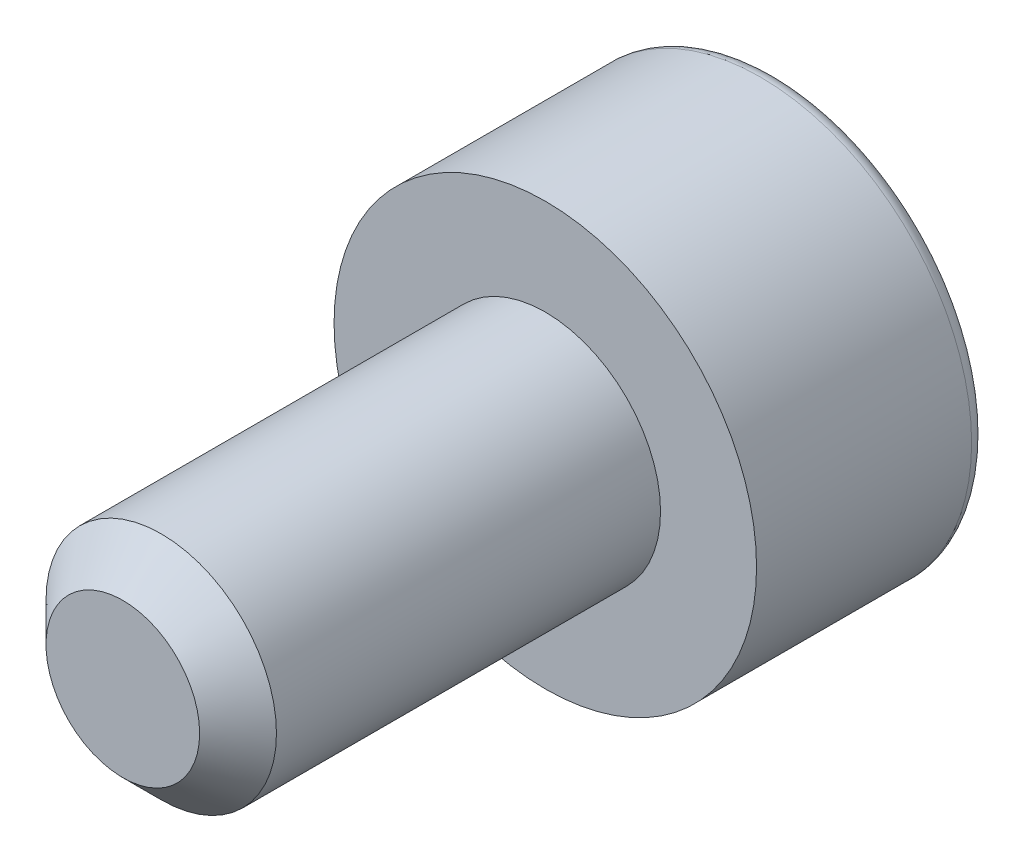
ISO-10303-21;
HEADER;
FILE_DESCRIPTION(('STEP AP214'),'2;1');
FILE_NAME('part.step','',(''),(''),'','','');
FILE_SCHEMA(('AUTOMOTIVE_DESIGN { 1 0 10303 214 1 1 1 1 }'));
ENDSEC;
DATA;
#1=APPLICATION_CONTEXT('core data for automotive mechanical design processes');
#2=APPLICATION_PROTOCOL_DEFINITION('international standard','automotive_design',2000,#1);
#3=PRODUCT_CONTEXT('',#1,'mechanical');
#4=PRODUCT('Part','Part','',(#3));
#5=PRODUCT_RELATED_PRODUCT_CATEGORY('part','',(#4));
#6=PRODUCT_DEFINITION_FORMATION('','',#4);
#7=PRODUCT_DEFINITION_CONTEXT('part definition',#1,'design');
#8=PRODUCT_DEFINITION('design','',#6,#7);
#9=PRODUCT_DEFINITION_SHAPE('','',#8);
#10=(LENGTH_UNIT() NAMED_UNIT(*) SI_UNIT(.MILLI.,.METRE.));
#11=(NAMED_UNIT(*) PLANE_ANGLE_UNIT() SI_UNIT($,.RADIAN.));
#12=(NAMED_UNIT(*) SI_UNIT($,.STERADIAN.) SOLID_ANGLE_UNIT());
#13=UNCERTAINTY_MEASURE_WITH_UNIT(LENGTH_MEASURE(1.E-05),#10,'distance_accuracy_value','');
#14=(GEOMETRIC_REPRESENTATION_CONTEXT(3) GLOBAL_UNCERTAINTY_ASSIGNED_CONTEXT((#13)) GLOBAL_UNIT_ASSIGNED_CONTEXT((#10,
#11,#12)) REPRESENTATION_CONTEXT('',''));
#15=CARTESIAN_POINT('',(0.,0.,0.));
#16=DIRECTION('',(0.,0.,1.));
#17=DIRECTION('',(1.,0.,0.));
#18=AXIS2_PLACEMENT_3D('',#15,#16,#17);
#19=CARTESIAN_POINT('',(0.,0.,3.));
#20=DIRECTION('',(0.,0.,1.));
#21=DIRECTION('',(1.,0.,0.));
#22=AXIS2_PLACEMENT_3D('',#19,#20,#21);
#23=PLANE('',#22);
#24=CARTESIAN_POINT('',(0.,0.,3.));
#25=DIRECTION('',(0.,0.,1.));
#26=DIRECTION('',(1.,0.,0.));
#27=AXIS2_PLACEMENT_3D('',#24,#25,#26);
#28=CIRCLE('',#27,2.75);
#29=CARTESIAN_POINT('',(2.75,0.,3.));
#30=VERTEX_POINT('',#29);
#31=EDGE_CURVE('E226',#30,#30,#28,.T.);
#32=ORIENTED_EDGE('',*,*,#31,.T.);
#33=EDGE_LOOP('',(#32));
#34=FACE_BOUND('',#33,.T.);
#35=CARTESIAN_POINT('',(0.,0.,3.));
#36=DIRECTION('',(0.,0.,1.));
#37=DIRECTION('',(1.,0.,0.));
#38=AXIS2_PLACEMENT_3D('',#35,#36,#37);
#39=CIRCLE('',#38,1.5);
#40=CARTESIAN_POINT('',(1.5,0.,3.));
#41=VERTEX_POINT('',#40);
#42=EDGE_CURVE('E228',#41,#41,#39,.T.);
#43=ORIENTED_EDGE('',*,*,#42,.F.);
#44=EDGE_LOOP('',(#43));
#45=FACE_BOUND('',#44,.T.);
#46=ADVANCED_FACE('F24',(#34,#45),#23,.T.);
#47=CARTESIAN_POINT('',(0.,0.,3.));
#48=DIRECTION('',(0.,0.,-1.));
#49=DIRECTION('',(-1.,0.,0.));
#50=AXIS2_PLACEMENT_3D('',#47,#48,#49);
#51=CYLINDRICAL_SURFACE('',#50,2.75);
#52=CARTESIAN_POINT('',(0.,0.,0.2));
#53=DIRECTION('',(0.,0.,1.));
#54=DIRECTION('',(1.,0.,0.));
#55=AXIS2_PLACEMENT_3D('',#52,#53,#54);
#56=CIRCLE('',#55,2.75);
#57=CARTESIAN_POINT('',(2.75,0.,0.2));
#58=VERTEX_POINT('',#57);
#59=EDGE_CURVE('E195',#58,#58,#56,.T.);
#60=ORIENTED_EDGE('',*,*,#59,.T.);
#61=EDGE_LOOP('',(#60));
#62=FACE_BOUND('',#61,.T.);
#63=ORIENTED_EDGE('',*,*,#31,.F.);
#64=EDGE_LOOP('',(#63));
#65=FACE_BOUND('',#64,.T.);
#66=ADVANCED_FACE('F26',(#62,#65),#51,.T.);
#67=CARTESIAN_POINT('',(0.,0.,0.));
#68=DIRECTION('',(0.,0.,1.));
#69=DIRECTION('',(1.,0.,0.));
#70=AXIS2_PLACEMENT_3D('',#67,#68,#69);
#71=PLANE('',#70);
#72=DIRECTION('',(0.5,0.866025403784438,0.));
#73=VECTOR('',#72,1.);
#74=CARTESIAN_POINT('',(-1.25573683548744,0.725000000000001,0.));
#75=LINE('',#74,#73);
#76=CARTESIAN_POINT('',(-0.837157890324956,1.45,0.));
#77=VERTEX_POINT('',#76);
#78=CARTESIAN_POINT('',(-1.67431578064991,0.,0.));
#79=VERTEX_POINT('',#78);
#80=EDGE_CURVE('E210',#77,#79,#75,.F.);
#81=ORIENTED_EDGE('',*,*,#80,.T.);
#82=DIRECTION('',(-0.5,0.866025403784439,0.));
#83=VECTOR('',#82,1.);
#84=CARTESIAN_POINT('',(-1.25573683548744,-0.725,0.));
#85=LINE('',#84,#83);
#86=CARTESIAN_POINT('',(-0.837157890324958,-1.45,0.));
#87=VERTEX_POINT('',#86);
#88=EDGE_CURVE('E207',#79,#87,#85,.F.);
#89=ORIENTED_EDGE('',*,*,#88,.T.);
#90=DIRECTION('',(-1.,0.,0.));
#91=VECTOR('',#90,1.);
#92=CARTESIAN_POINT('',(0.,-1.45,0.));
#93=LINE('',#92,#91);
#94=CARTESIAN_POINT('',(0.837157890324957,-1.45,0.));
#95=VERTEX_POINT('',#94);
#96=EDGE_CURVE('E218',#87,#95,#93,.F.);
#97=ORIENTED_EDGE('',*,*,#96,.T.);
#98=DIRECTION('',(-0.500000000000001,-0.866025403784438,0.));
#99=VECTOR('',#98,1.);
#100=CARTESIAN_POINT('',(1.25573683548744,-0.725000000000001,0.));
#101=LINE('',#100,#99);
#102=CARTESIAN_POINT('',(1.67431578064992,0.,0.));
#103=VERTEX_POINT('',#102);
#104=EDGE_CURVE('E216',#95,#103,#101,.F.);
#105=ORIENTED_EDGE('',*,*,#104,.T.);
#106=DIRECTION('',(0.5,-0.866025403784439,0.));
#107=VECTOR('',#106,1.);
#108=CARTESIAN_POINT('',(1.25573683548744,0.725,0.));
#109=LINE('',#108,#107);
#110=CARTESIAN_POINT('',(0.837157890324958,1.45,0.));
#111=VERTEX_POINT('',#110);
#112=EDGE_CURVE('E214',#103,#111,#109,.F.);
#113=ORIENTED_EDGE('',*,*,#112,.T.);
#114=DIRECTION('',(1.,0.,0.));
#115=VECTOR('',#114,1.);
#116=CARTESIAN_POINT('',(0.,1.45,0.));
#117=LINE('',#116,#115);
#118=EDGE_CURVE('E212',#111,#77,#117,.F.);
#119=ORIENTED_EDGE('',*,*,#118,.T.);
#120=EDGE_LOOP('',(#81,#89,#97,#105,#113,#119));
#121=FACE_BOUND('',#120,.T.);
#122=CARTESIAN_POINT('',(0.,0.,0.));
#123=DIRECTION('',(0.,0.,1.));
#124=DIRECTION('',(1.,0.,0.));
#125=AXIS2_PLACEMENT_3D('',#122,#123,#124);
#126=CIRCLE('',#125,2.55);
#127=CARTESIAN_POINT('',(2.55,0.,0.));
#128=VERTEX_POINT('',#127);
#129=EDGE_CURVE('E220',#128,#128,#126,.F.);
#130=ORIENTED_EDGE('',*,*,#129,.T.);
#131=EDGE_LOOP('',(#130));
#132=FACE_BOUND('',#131,.T.);
#133=ADVANCED_FACE('F118',(#121,#132),#71,.F.);
#134=CARTESIAN_POINT('',(0.,0.,8.5));
#135=DIRECTION('',(0.,0.,-1.));
#136=DIRECTION('',(-1.,0.,0.));
#137=AXIS2_PLACEMENT_3D('',#134,#135,#136);
#138=CYLINDRICAL_SURFACE('',#137,1.5);
#139=CARTESIAN_POINT('',(0.,0.,8.));
#140=DIRECTION('',(0.,0.,1.));
#141=DIRECTION('',(1.,0.,0.));
#142=AXIS2_PLACEMENT_3D('',#139,#140,#141);
#143=CIRCLE('',#142,1.5);
#144=CARTESIAN_POINT('',(1.5,0.,8.));
#145=VERTEX_POINT('',#144);
#146=EDGE_CURVE('E11',#145,#145,#143,.F.);
#147=ORIENTED_EDGE('',*,*,#146,.T.);
#148=EDGE_LOOP('',(#147));
#149=FACE_BOUND('',#148,.T.);
#150=ORIENTED_EDGE('',*,*,#42,.T.);
#151=EDGE_LOOP('',(#150));
#152=FACE_BOUND('',#151,.T.);
#153=ADVANCED_FACE('F125',(#149,#152),#138,.T.);
#154=CARTESIAN_POINT('',(0.,0.,8.5));
#155=DIRECTION('',(0.,0.,1.));
#156=DIRECTION('',(1.,0.,0.));
#157=AXIS2_PLACEMENT_3D('',#154,#155,#156);
#158=PLANE('',#157);
#159=CARTESIAN_POINT('',(0.,0.,8.5));
#160=DIRECTION('',(0.,0.,1.));
#161=DIRECTION('',(1.,0.,0.));
#162=AXIS2_PLACEMENT_3D('',#159,#160,#161);
#163=CIRCLE('',#162,0.999999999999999);
#164=CARTESIAN_POINT('',(0.999999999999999,0.,8.5));
#165=VERTEX_POINT('',#164);
#166=EDGE_CURVE('E32',#165,#165,#163,.T.);
#167=ORIENTED_EDGE('',*,*,#166,.T.);
#168=EDGE_LOOP('',(#167));
#169=FACE_BOUND('',#168,.T.);
#170=ADVANCED_FACE('F129',(#169),#158,.T.);
#171=CARTESIAN_POINT('',(1.44337567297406,0.,1.9));
#172=DIRECTION('',(0.866025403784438,-0.500000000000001,0.));
#173=DIRECTION('',(0.500000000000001,0.866025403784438,0.));
#174=AXIS2_PLACEMENT_3D('',#171,#172,#173);
#175=PLANE('',#174);
#176=DIRECTION('',(0.,0.,-1.));
#177=VECTOR('',#176,1.);
#178=CARTESIAN_POINT('',(1.44337567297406,0.,1.9));
#179=LINE('',#178,#177);
#180=CARTESIAN_POINT('',(1.44337567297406,0.,1.9));
#181=VERTEX_POINT('',#180);
#182=CARTESIAN_POINT('',(1.44337567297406,0.,0.200000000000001));
#183=VERTEX_POINT('',#182);
#184=EDGE_CURVE('E231',#181,#183,#179,.T.);
#185=ORIENTED_EDGE('',*,*,#184,.T.);
#186=DIRECTION('',(-0.500000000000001,-0.866025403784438,0.));
#187=VECTOR('',#186,1.);
#188=CARTESIAN_POINT('',(1.44337567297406,0.,0.2));
#189=LINE('',#188,#187);
#190=CARTESIAN_POINT('',(0.721687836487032,-1.25,0.200000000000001));
#191=VERTEX_POINT('',#190);
#192=EDGE_CURVE('E39',#183,#191,#189,.T.);
#193=ORIENTED_EDGE('',*,*,#192,.T.);
#194=DIRECTION('',(0.,0.,-1.));
#195=VECTOR('',#194,1.);
#196=CARTESIAN_POINT('',(0.721687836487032,-1.25,1.9));
#197=LINE('',#196,#195);
#198=CARTESIAN_POINT('',(0.721687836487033,-1.25,1.9));
#199=VERTEX_POINT('',#198);
#200=EDGE_CURVE('E232',#199,#191,#197,.T.);
#201=ORIENTED_EDGE('',*,*,#200,.F.);
#202=DIRECTION('',(-0.500000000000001,-0.866025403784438,0.));
#203=VECTOR('',#202,1.);
#204=CARTESIAN_POINT('',(1.44337567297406,0.,1.9));
#205=LINE('',#204,#203);
#206=EDGE_CURVE('E257',#181,#199,#205,.T.);
#207=ORIENTED_EDGE('',*,*,#206,.F.);
#208=EDGE_LOOP('',(#185,#193,#201,#207));
#209=FACE_BOUND('',#208,.T.);
#210=ADVANCED_FACE('F133',(#209),#175,.F.);
#211=CARTESIAN_POINT('',(0.721687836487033,1.25,1.9));
#212=DIRECTION('',(0.866025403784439,0.5,0.));
#213=DIRECTION('',(-0.5,0.866025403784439,0.));
#214=AXIS2_PLACEMENT_3D('',#211,#212,#213);
#215=PLANE('',#214);
#216=DIRECTION('',(0.,0.,-1.));
#217=VECTOR('',#216,1.);
#218=CARTESIAN_POINT('',(0.721687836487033,1.25,1.9));
#219=LINE('',#218,#217);
#220=CARTESIAN_POINT('',(0.721687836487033,1.25,1.9));
#221=VERTEX_POINT('',#220);
#222=CARTESIAN_POINT('',(0.721687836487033,1.25,0.200000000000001));
#223=VERTEX_POINT('',#222);
#224=EDGE_CURVE('E244',#221,#223,#219,.T.);
#225=ORIENTED_EDGE('',*,*,#224,.T.);
#226=DIRECTION('',(0.5,-0.866025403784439,0.));
#227=VECTOR('',#226,1.);
#228=CARTESIAN_POINT('',(0.721687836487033,1.25,0.2));
#229=LINE('',#228,#227);
#230=EDGE_CURVE('E47',#223,#183,#229,.T.);
#231=ORIENTED_EDGE('',*,*,#230,.T.);
#232=ORIENTED_EDGE('',*,*,#184,.F.);
#233=DIRECTION('',(0.5,-0.866025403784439,0.));
#234=VECTOR('',#233,1.);
#235=CARTESIAN_POINT('',(0.721687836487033,1.25,1.9));
#236=LINE('',#235,#234);
#237=EDGE_CURVE('E235',#221,#181,#236,.T.);
#238=ORIENTED_EDGE('',*,*,#237,.F.);
#239=EDGE_LOOP('',(#225,#231,#232,#238));
#240=FACE_BOUND('',#239,.T.);
#241=ADVANCED_FACE('F137',(#240),#215,.F.);
#242=CARTESIAN_POINT('',(-0.721687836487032,1.25,1.9));
#243=DIRECTION('',(0.,1.,0.));
#244=DIRECTION('',(-1.,0.,0.));
#245=AXIS2_PLACEMENT_3D('',#242,#243,#244);
#246=PLANE('',#245);
#247=DIRECTION('',(0.,0.,-1.));
#248=VECTOR('',#247,1.);
#249=CARTESIAN_POINT('',(-0.721687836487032,1.25,1.9));
#250=LINE('',#249,#248);
#251=CARTESIAN_POINT('',(-0.721687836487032,1.25,1.9));
#252=VERTEX_POINT('',#251);
#253=CARTESIAN_POINT('',(-0.721687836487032,1.25,0.200000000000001));
#254=VERTEX_POINT('',#253);
#255=EDGE_CURVE('E241',#252,#254,#250,.T.);
#256=ORIENTED_EDGE('',*,*,#255,.T.);
#257=DIRECTION('',(1.,0.,0.));
#258=VECTOR('',#257,1.);
#259=CARTESIAN_POINT('',(-0.721687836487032,1.25,0.2));
#260=LINE('',#259,#258);
#261=EDGE_CURVE('E203',#254,#223,#260,.T.);
#262=ORIENTED_EDGE('',*,*,#261,.T.);
#263=ORIENTED_EDGE('',*,*,#224,.F.);
#264=DIRECTION('',(1.,0.,0.));
#265=VECTOR('',#264,1.);
#266=CARTESIAN_POINT('',(-0.721687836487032,1.25,1.9));
#267=LINE('',#266,#265);
#268=EDGE_CURVE('E248',#252,#221,#267,.T.);
#269=ORIENTED_EDGE('',*,*,#268,.F.);
#270=EDGE_LOOP('',(#256,#262,#263,#269));
#271=FACE_BOUND('',#270,.T.);
#272=ADVANCED_FACE('F150',(#271),#246,.F.);
#273=CARTESIAN_POINT('',(-1.44337567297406,0.,1.9));
#274=DIRECTION('',(-0.866025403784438,0.5,0.));
#275=DIRECTION('',(-0.5,-0.866025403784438,0.));
#276=AXIS2_PLACEMENT_3D('',#273,#274,#275);
#277=PLANE('',#276);
#278=DIRECTION('',(0.,0.,-1.));
#279=VECTOR('',#278,1.);
#280=CARTESIAN_POINT('',(-1.44337567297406,0.,1.9));
#281=LINE('',#280,#279);
#282=CARTESIAN_POINT('',(-1.44337567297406,0.,1.9));
#283=VERTEX_POINT('',#282);
#284=CARTESIAN_POINT('',(-1.44337567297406,0.,0.200000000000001));
#285=VERTEX_POINT('',#284);
#286=EDGE_CURVE('E238',#283,#285,#281,.T.);
#287=ORIENTED_EDGE('',*,*,#286,.T.);
#288=DIRECTION('',(0.5,0.866025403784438,0.));
#289=VECTOR('',#288,1.);
#290=CARTESIAN_POINT('',(-1.44337567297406,0.,0.2));
#291=LINE('',#290,#289);
#292=EDGE_CURVE('E205',#285,#254,#291,.T.);
#293=ORIENTED_EDGE('',*,*,#292,.T.);
#294=ORIENTED_EDGE('',*,*,#255,.F.);
#295=DIRECTION('',(0.5,0.866025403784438,0.));
#296=VECTOR('',#295,1.);
#297=CARTESIAN_POINT('',(-1.44337567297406,0.,1.9));
#298=LINE('',#297,#296);
#299=EDGE_CURVE('E251',#283,#252,#298,.T.);
#300=ORIENTED_EDGE('',*,*,#299,.F.);
#301=EDGE_LOOP('',(#287,#293,#294,#300));
#302=FACE_BOUND('',#301,.T.);
#303=ADVANCED_FACE('F146',(#302),#277,.F.);
#304=CARTESIAN_POINT('',(-0.721687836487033,-1.25,1.9));
#305=DIRECTION('',(-0.866025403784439,-0.5,0.));
#306=DIRECTION('',(0.5,-0.866025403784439,0.));
#307=AXIS2_PLACEMENT_3D('',#304,#305,#306);
#308=PLANE('',#307);
#309=DIRECTION('',(0.,0.,-1.));
#310=VECTOR('',#309,1.);
#311=CARTESIAN_POINT('',(-0.721687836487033,-1.25,1.9));
#312=LINE('',#311,#310);
#313=CARTESIAN_POINT('',(-0.721687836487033,-1.25,1.9));
#314=VERTEX_POINT('',#313);
#315=CARTESIAN_POINT('',(-0.721687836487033,-1.25,0.200000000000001));
#316=VERTEX_POINT('',#315);
#317=EDGE_CURVE('E234',#314,#316,#312,.T.);
#318=ORIENTED_EDGE('',*,*,#317,.T.);
#319=DIRECTION('',(-0.5,0.866025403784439,0.));
#320=VECTOR('',#319,1.);
#321=CARTESIAN_POINT('',(-0.721687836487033,-1.25,0.2));
#322=LINE('',#321,#320);
#323=EDGE_CURVE('E223',#316,#285,#322,.T.);
#324=ORIENTED_EDGE('',*,*,#323,.T.);
#325=ORIENTED_EDGE('',*,*,#286,.F.);
#326=DIRECTION('',(-0.5,0.866025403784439,0.));
#327=VECTOR('',#326,1.);
#328=CARTESIAN_POINT('',(-0.721687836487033,-1.25,1.9));
#329=LINE('',#328,#327);
#330=EDGE_CURVE('E253',#314,#283,#329,.T.);
#331=ORIENTED_EDGE('',*,*,#330,.F.);
#332=EDGE_LOOP('',(#318,#324,#325,#331));
#333=FACE_BOUND('',#332,.T.);
#334=ADVANCED_FACE('F142',(#333),#308,.F.);
#335=CARTESIAN_POINT('',(0.721687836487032,-1.25,1.9));
#336=DIRECTION('',(0.,-1.,0.));
#337=DIRECTION('',(1.,0.,0.));
#338=AXIS2_PLACEMENT_3D('',#335,#336,#337);
#339=PLANE('',#338);
#340=ORIENTED_EDGE('',*,*,#200,.T.);
#341=DIRECTION('',(-1.,0.,0.));
#342=VECTOR('',#341,1.);
#343=CARTESIAN_POINT('',(0.721687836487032,-1.25,0.2));
#344=LINE('',#343,#342);
#345=EDGE_CURVE('E197',#191,#316,#344,.T.);
#346=ORIENTED_EDGE('',*,*,#345,.T.);
#347=ORIENTED_EDGE('',*,*,#317,.F.);
#348=DIRECTION('',(-1.,0.,0.));
#349=VECTOR('',#348,1.);
#350=CARTESIAN_POINT('',(0.721687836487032,-1.25,1.9));
#351=LINE('',#350,#349);
#352=EDGE_CURVE('E255',#199,#314,#351,.T.);
#353=ORIENTED_EDGE('',*,*,#352,.F.);
#354=EDGE_LOOP('',(#340,#346,#347,#353));
#355=FACE_BOUND('',#354,.T.);
#356=ADVANCED_FACE('F138',(#355),#339,.F.);
#357=CARTESIAN_POINT('',(0.894892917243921,1.35,0.2));
#358=DIRECTION('',(0.5,-0.866025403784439,0.));
#359=DIRECTION('',(0.866025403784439,0.5,0.));
#360=AXIS2_PLACEMENT_3D('',#357,#358,#359);
#361=CYLINDRICAL_SURFACE('',#360,0.2);
#362=CARTESIAN_POINT('',(0.837157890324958,1.45,0.2));
#363=DIRECTION('',(0.866025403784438,-0.5,0.));
#364=DIRECTION('',(0.5,0.866025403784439,0.));
#365=AXIS2_PLACEMENT_3D('',#362,#363,#364);
#366=ELLIPSE('',#365,0.23094010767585,0.2);
#367=EDGE_CURVE('E262',#111,#223,#366,.F.);
#368=ORIENTED_EDGE('',*,*,#367,.F.);
#369=ORIENTED_EDGE('',*,*,#112,.F.);
#370=CARTESIAN_POINT('',(1.67431578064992,0.,0.2));
#371=DIRECTION('',(0.,-1.,0.));
#372=DIRECTION('',(1.,0.,0.));
#373=AXIS2_PLACEMENT_3D('',#370,#371,#372);
#374=ELLIPSE('',#373,0.23094010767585,0.2);
#375=EDGE_CURVE('E259',#183,#103,#374,.T.);
#376=ORIENTED_EDGE('',*,*,#375,.F.);
#377=ORIENTED_EDGE('',*,*,#230,.F.);
#378=EDGE_LOOP('',(#368,#369,#376,#377));
#379=FACE_BOUND('',#378,.T.);
#380=ADVANCED_FACE('F141',(#379),#361,.T.);
#381=CARTESIAN_POINT('',(1.61658075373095,-0.1,0.2));
#382=DIRECTION('',(-0.500000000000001,-0.866025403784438,0.));
#383=DIRECTION('',(0.866025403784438,-0.500000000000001,0.));
#384=AXIS2_PLACEMENT_3D('',#381,#382,#383);
#385=CYLINDRICAL_SURFACE('',#384,0.2);
#386=ORIENTED_EDGE('',*,*,#375,.T.);
#387=ORIENTED_EDGE('',*,*,#104,.F.);
#388=CARTESIAN_POINT('',(0.837157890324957,-1.45,0.2));
#389=DIRECTION('',(-0.866025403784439,-0.5,0.));
#390=DIRECTION('',(0.499999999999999,-0.866025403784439,0.));
#391=AXIS2_PLACEMENT_3D('',#388,#389,#390);
#392=ELLIPSE('',#391,0.23094010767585,0.2);
#393=EDGE_CURVE('E265',#191,#95,#392,.T.);
#394=ORIENTED_EDGE('',*,*,#393,.F.);
#395=ORIENTED_EDGE('',*,*,#192,.F.);
#396=EDGE_LOOP('',(#386,#387,#394,#395));
#397=FACE_BOUND('',#396,.T.);
#398=ADVANCED_FACE('F159',(#397),#385,.T.);
#399=CARTESIAN_POINT('',(-0.721687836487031,1.45,0.2));
#400=DIRECTION('',(1.,0.,0.));
#401=DIRECTION('',(0.,1.,0.));
#402=AXIS2_PLACEMENT_3D('',#399,#400,#401);
#403=CYLINDRICAL_SURFACE('',#402,0.2);
#404=ORIENTED_EDGE('',*,*,#367,.T.);
#405=ORIENTED_EDGE('',*,*,#261,.F.);
#406=CARTESIAN_POINT('',(-0.837157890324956,1.45,0.2));
#407=DIRECTION('',(0.866025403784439,0.5,0.));
#408=DIRECTION('',(-0.5,0.866025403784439,0.));
#409=AXIS2_PLACEMENT_3D('',#406,#407,#408);
#410=ELLIPSE('',#409,0.23094010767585,0.2);
#411=EDGE_CURVE('E268',#77,#254,#410,.F.);
#412=ORIENTED_EDGE('',*,*,#411,.F.);
#413=ORIENTED_EDGE('',*,*,#118,.F.);
#414=EDGE_LOOP('',(#404,#405,#412,#413));
#415=FACE_BOUND('',#414,.T.);
#416=ADVANCED_FACE('F163',(#415),#403,.T.);
#417=CARTESIAN_POINT('',(0.721687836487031,-1.45,0.2));
#418=DIRECTION('',(-1.,0.,0.));
#419=DIRECTION('',(0.,-1.,0.));
#420=AXIS2_PLACEMENT_3D('',#417,#418,#419);
#421=CYLINDRICAL_SURFACE('',#420,0.2);
#422=ORIENTED_EDGE('',*,*,#393,.T.);
#423=ORIENTED_EDGE('',*,*,#96,.F.);
#424=CARTESIAN_POINT('',(-0.837157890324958,-1.45,0.2));
#425=DIRECTION('',(-0.866025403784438,0.5,0.));
#426=DIRECTION('',(0.5,0.866025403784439,0.));
#427=AXIS2_PLACEMENT_3D('',#424,#425,#426);
#428=ELLIPSE('',#427,0.23094010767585,0.2);
#429=EDGE_CURVE('E271',#316,#87,#428,.T.);
#430=ORIENTED_EDGE('',*,*,#429,.F.);
#431=ORIENTED_EDGE('',*,*,#345,.F.);
#432=EDGE_LOOP('',(#422,#423,#430,#431));
#433=FACE_BOUND('',#432,.T.);
#434=ADVANCED_FACE('F167',(#433),#421,.T.);
#435=CARTESIAN_POINT('',(-1.61658075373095,0.100000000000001,0.2));
#436=DIRECTION('',(0.5,0.866025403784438,0.));
#437=DIRECTION('',(-0.866025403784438,0.5,0.));
#438=AXIS2_PLACEMENT_3D('',#435,#436,#437);
#439=CYLINDRICAL_SURFACE('',#438,0.2);
#440=ORIENTED_EDGE('',*,*,#411,.T.);
#441=ORIENTED_EDGE('',*,*,#292,.F.);
#442=CARTESIAN_POINT('',(-1.67431578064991,0.,0.2));
#443=DIRECTION('',(0.,1.,0.));
#444=DIRECTION('',(-1.,0.,0.));
#445=AXIS2_PLACEMENT_3D('',#442,#443,#444);
#446=ELLIPSE('',#445,0.23094010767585,0.2);
#447=EDGE_CURVE('E273',#79,#285,#446,.F.);
#448=ORIENTED_EDGE('',*,*,#447,.F.);
#449=ORIENTED_EDGE('',*,*,#80,.F.);
#450=EDGE_LOOP('',(#440,#441,#448,#449));
#451=FACE_BOUND('',#450,.T.);
#452=ADVANCED_FACE('F171',(#451),#439,.T.);
#453=CARTESIAN_POINT('',(-0.894892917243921,-1.35,0.2));
#454=DIRECTION('',(-0.5,0.866025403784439,0.));
#455=DIRECTION('',(-0.866025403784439,-0.5,0.));
#456=AXIS2_PLACEMENT_3D('',#453,#454,#455);
#457=CYLINDRICAL_SURFACE('',#456,0.2);
#458=ORIENTED_EDGE('',*,*,#429,.T.);
#459=ORIENTED_EDGE('',*,*,#88,.F.);
#460=ORIENTED_EDGE('',*,*,#447,.T.);
#461=ORIENTED_EDGE('',*,*,#323,.F.);
#462=EDGE_LOOP('',(#458,#459,#460,#461));
#463=FACE_BOUND('',#462,.T.);
#464=ADVANCED_FACE('F175',(#463),#457,.T.);
#465=CARTESIAN_POINT('',(0.,0.,0.2));
#466=DIRECTION('',(0.,0.,1.));
#467=DIRECTION('',(1.,0.,0.));
#468=AXIS2_PLACEMENT_3D('',#465,#466,#467);
#469=TOROIDAL_SURFACE('',#468,2.55,0.2);
#470=ORIENTED_EDGE('',*,*,#129,.F.);
#471=EDGE_LOOP('',(#470));
#472=FACE_BOUND('',#471,.T.);
#473=ORIENTED_EDGE('',*,*,#59,.F.);
#474=EDGE_LOOP('',(#473));
#475=FACE_BOUND('',#474,.T.);
#476=ADVANCED_FACE('F179',(#472,#475),#469,.T.);
#477=CARTESIAN_POINT('',(0.,0.,8.5));
#478=DIRECTION('',(0.,0.,-1.));
#479=DIRECTION('',(-1.,0.,0.));
#480=AXIS2_PLACEMENT_3D('',#477,#478,#479);
#481=CONICAL_SURFACE('',#480,0.999999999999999,0.785398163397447);
#482=ORIENTED_EDGE('',*,*,#146,.F.);
#483=EDGE_LOOP('',(#482));
#484=FACE_BOUND('',#483,.T.);
#485=ORIENTED_EDGE('',*,*,#166,.F.);
#486=EDGE_LOOP('',(#485));
#487=FACE_BOUND('',#486,.T.);
#488=ADVANCED_FACE('F182',(#484,#487),#481,.T.);
#489=CARTESIAN_POINT('',(1.44337567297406,0.,1.9));
#490=DIRECTION('',(0.,0.,1.));
#491=DIRECTION('',(1.,0.,0.));
#492=AXIS2_PLACEMENT_3D('',#489,#490,#491);
#493=PLANE('',#492);
#494=ORIENTED_EDGE('',*,*,#206,.T.);
#495=CARTESIAN_POINT('',(0.,0.,1.9));
#496=DIRECTION('',(0.,0.,-1.));
#497=DIRECTION('',(-1.,0.,0.));
#498=AXIS2_PLACEMENT_3D('',#495,#496,#497);
#499=CIRCLE('',#498,1.44337567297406);
#500=EDGE_CURVE('E285',#181,#199,#499,.T.);
#501=ORIENTED_EDGE('',*,*,#500,.F.);
#502=EDGE_LOOP('',(#494,#501));
#503=FACE_BOUND('',#502,.T.);
#504=ADVANCED_FACE('F110',(#503),#493,.T.);
#505=ORIENTED_EDGE('',*,*,#352,.T.);
#506=EDGE_CURVE('E282',#199,#314,#499,.T.);
#507=ORIENTED_EDGE('',*,*,#506,.F.);
#508=EDGE_LOOP('',(#505,#507));
#509=FACE_BOUND('',#508,.T.);
#510=ADVANCED_FACE('F189',(#509),#493,.T.);
#511=ORIENTED_EDGE('',*,*,#330,.T.);
#512=EDGE_CURVE('E277',#314,#283,#499,.T.);
#513=ORIENTED_EDGE('',*,*,#512,.F.);
#514=EDGE_LOOP('',(#511,#513));
#515=FACE_BOUND('',#514,.T.);
#516=ADVANCED_FACE('F299',(#515),#493,.T.);
#517=ORIENTED_EDGE('',*,*,#299,.T.);
#518=EDGE_CURVE('E275',#283,#252,#499,.T.);
#519=ORIENTED_EDGE('',*,*,#518,.F.);
#520=EDGE_LOOP('',(#517,#519));
#521=FACE_BOUND('',#520,.T.);
#522=ADVANCED_FACE('F307',(#521),#493,.T.);
#523=ORIENTED_EDGE('',*,*,#268,.T.);
#524=EDGE_CURVE('E276',#252,#221,#499,.T.);
#525=ORIENTED_EDGE('',*,*,#524,.F.);
#526=EDGE_LOOP('',(#523,#525));
#527=FACE_BOUND('',#526,.T.);
#528=ADVANCED_FACE('F107',(#527),#493,.T.);
#529=ORIENTED_EDGE('',*,*,#237,.T.);
#530=EDGE_CURVE('E281',#221,#181,#499,.T.);
#531=ORIENTED_EDGE('',*,*,#530,.F.);
#532=EDGE_LOOP('',(#529,#531));
#533=FACE_BOUND('',#532,.T.);
#534=ADVANCED_FACE('F101',(#533),#493,.T.);
#535=CARTESIAN_POINT('',(0.,0.,2.5));
#536=DIRECTION('',(0.,0.,-1.));
#537=DIRECTION('',(-1.,0.,0.));
#538=AXIS2_PLACEMENT_3D('',#535,#536,#537);
#539=CONICAL_SURFACE('',#538,0.,1.17683581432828);
#540=ORIENTED_EDGE('',*,*,#518,.T.);
#541=ORIENTED_EDGE('',*,*,#524,.T.);
#542=ORIENTED_EDGE('',*,*,#530,.T.);
#543=ORIENTED_EDGE('',*,*,#500,.T.);
#544=ORIENTED_EDGE('',*,*,#506,.T.);
#545=ORIENTED_EDGE('',*,*,#512,.T.);
#546=EDGE_LOOP('',(#540,#541,#542,#543,#544,#545));
#547=FACE_BOUND('',#546,.T.);
#548=CARTESIAN_POINT('',(0.,0.,2.5));
#549=VERTEX_POINT('',#548);
#550=VERTEX_LOOP('',#549);
#551=FACE_BOUND('',#550,.T.);
#552=ADVANCED_FACE('F99',(#547,#551),#539,.F.);
#553=CLOSED_SHELL('',(#46,#66,#133,#153,#170,#210,#241,#272,#303,#334,#356,#380,#398,#416,#434,
#452,#464,#476,#488,#504,#510,#516,#522,#528,#534,#552));
#554=MANIFOLD_SOLID_BREP('B2',#553);
#555=ADVANCED_BREP_SHAPE_REPRESENTATION('',(#18,#554),#14);
#556=SHAPE_DEFINITION_REPRESENTATION(#9,#555);
ENDSEC;
END-ISO-10303-21;
